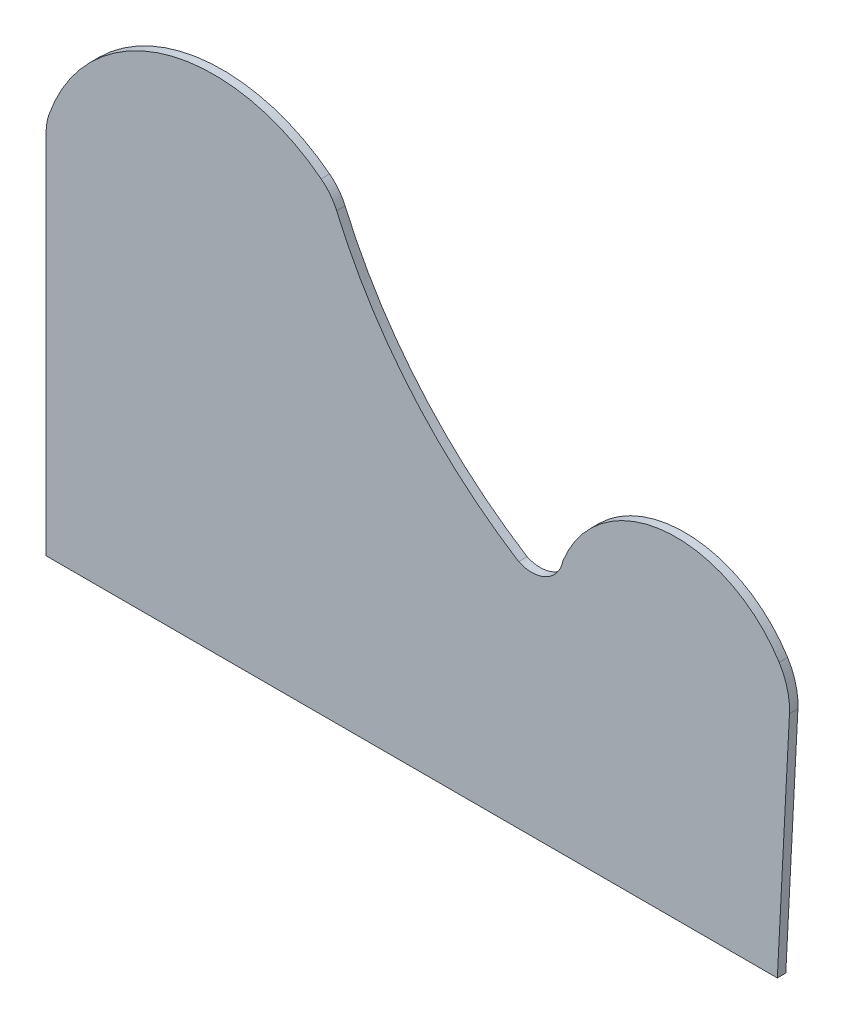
ISO-10303-21;
HEADER;
FILE_DESCRIPTION(('STEP AP214'),'2;1');
FILE_NAME('part.step','',(''),(''),'','','');
FILE_SCHEMA(('AUTOMOTIVE_DESIGN { 1 0 10303 214 1 1 1 1 }'));
ENDSEC;
DATA;
#1=APPLICATION_CONTEXT('core data for automotive mechanical design processes');
#2=APPLICATION_PROTOCOL_DEFINITION('international standard','automotive_design',2000,#1);
#3=PRODUCT_CONTEXT('',#1,'mechanical');
#4=PRODUCT('Part','Part','',(#3));
#5=PRODUCT_RELATED_PRODUCT_CATEGORY('part','',(#4));
#6=PRODUCT_DEFINITION_FORMATION('','',#4);
#7=PRODUCT_DEFINITION_CONTEXT('part definition',#1,'design');
#8=PRODUCT_DEFINITION('design','',#6,#7);
#9=PRODUCT_DEFINITION_SHAPE('','',#8);
#10=(LENGTH_UNIT() NAMED_UNIT(*) SI_UNIT(.MILLI.,.METRE.));
#11=(NAMED_UNIT(*) PLANE_ANGLE_UNIT() SI_UNIT($,.RADIAN.));
#12=(NAMED_UNIT(*) SI_UNIT($,.STERADIAN.) SOLID_ANGLE_UNIT());
#13=UNCERTAINTY_MEASURE_WITH_UNIT(LENGTH_MEASURE(1.E-05),#10,'distance_accuracy_value','');
#14=(GEOMETRIC_REPRESENTATION_CONTEXT(3) GLOBAL_UNCERTAINTY_ASSIGNED_CONTEXT((#13)) GLOBAL_UNIT_ASSIGNED_CONTEXT((#10,
#11,#12)) REPRESENTATION_CONTEXT('',''));
#15=CARTESIAN_POINT('',(0.,0.,0.));
#16=DIRECTION('',(0.,0.,1.));
#17=DIRECTION('',(1.,0.,0.));
#18=AXIS2_PLACEMENT_3D('',#15,#16,#17);
#19=CARTESIAN_POINT('',(0.,0.,-15.));
#20=DIRECTION('',(0.,0.,1.));
#21=DIRECTION('',(1.,0.,0.));
#22=AXIS2_PLACEMENT_3D('',#19,#20,#21);
#23=PLANE('',#22);
#24=DIRECTION('',(-0.0515364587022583,-0.998671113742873,0.));
#25=VECTOR('',#24,1.);
#26=CARTESIAN_POINT('',(518.072036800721,-26.7351260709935,-15.));
#27=LINE('',#26,#25);
#28=CARTESIAN_POINT('',(535.595522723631,312.834173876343,-15.));
#29=VERTEX_POINT('',#28);
#30=CARTESIAN_POINT('',(528.430035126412,173.981686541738,-15.));
#31=VERTEX_POINT('',#30);
#32=EDGE_CURVE('E114',#29,#31,#27,.T.);
#33=ORIENTED_EDGE('',*,*,#32,.T.);
#34=DIRECTION('',(-1.,0.,0.));
#35=VECTOR('',#34,1.);
#36=CARTESIAN_POINT('',(0.,173.981686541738,-15.));
#37=LINE('',#36,#35);
#38=CARTESIAN_POINT('',(96.0120985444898,173.981686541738,-15.));
#39=VERTEX_POINT('',#38);
#40=EDGE_CURVE('E140',#31,#39,#37,.T.);
#41=ORIENTED_EDGE('',*,*,#40,.T.);
#42=DIRECTION('',(0.,1.,0.));
#43=VECTOR('',#42,1.);
#44=CARTESIAN_POINT('',(96.0120985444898,0.,-15.));
#45=LINE('',#44,#43);
#46=CARTESIAN_POINT('',(96.0120985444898,390.867481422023,-15.));
#47=VERTEX_POINT('',#46);
#48=EDGE_CURVE('E136',#39,#47,#45,.T.);
#49=ORIENTED_EDGE('',*,*,#48,.T.);
#50=CARTESIAN_POINT('',(126.01209854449,390.867481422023,-15.));
#51=DIRECTION('',(0.,0.,1.));
#52=DIRECTION('',(1.,0.,0.));
#53=AXIS2_PLACEMENT_3D('',#50,#51,#52);
#54=CIRCLE('',#53,30.);
#55=CARTESIAN_POINT('',(97.6798278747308,400.730667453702,-15.));
#56=VERTEX_POINT('',#55);
#57=EDGE_CURVE('E142',#47,#56,#54,.F.);
#58=ORIENTED_EDGE('',*,*,#57,.T.);
#59=CARTESIAN_POINT('',(195.279411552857,366.753763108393,-15.));
#60=DIRECTION('',(0.,0.,1.));
#61=DIRECTION('',(1.,0.,0.));
#62=AXIS2_PLACEMENT_3D('',#59,#60,#61);
#63=CIRCLE('',#62,103.344611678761);
#64=CARTESIAN_POINT('',(258.713492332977,448.339461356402,-15.));
#65=VERTEX_POINT('',#64);
#66=EDGE_CURVE('E103',#56,#65,#63,.F.);
#67=ORIENTED_EDGE('',*,*,#66,.T.);
#68=CARTESIAN_POINT('',(240.299156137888,424.655875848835,-15.));
#69=DIRECTION('',(0.,0.,1.));
#70=DIRECTION('',(1.,0.,0.));
#71=AXIS2_PLACEMENT_3D('',#68,#69,#70);
#72=CIRCLE('',#71,30.);
#73=CARTESIAN_POINT('',(267.825723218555,436.584333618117,-15.));
#74=VERTEX_POINT('',#73);
#75=EDGE_CURVE('E119',#65,#74,#72,.F.);
#76=ORIENTED_EDGE('',*,*,#75,.T.);
#77=CARTESIAN_POINT('',(526.01209854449,548.467710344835,-15.));
#78=DIRECTION('',(0.,0.,1.));
#79=DIRECTION('',(1.,0.,0.));
#80=AXIS2_PLACEMENT_3D('',#77,#78,#79);
#81=CIRCLE('',#80,281.386023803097);
#82=CARTESIAN_POINT('',(375.446572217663,310.753350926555,-15.));
#83=VERTEX_POINT('',#82);
#84=EDGE_CURVE('E96',#83,#74,#81,.F.);
#85=ORIENTED_EDGE('',*,*,#84,.F.);
#86=CARTESIAN_POINT('',(383.206392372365,327.832005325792,-15.));
#87=DIRECTION('',(0.,0.,1.));
#88=DIRECTION('',(1.,0.,0.));
#89=AXIS2_PLACEMENT_3D('',#86,#87,#88);
#90=CIRCLE('',#89,18.7588710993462);
#91=CARTESIAN_POINT('',(401.59368414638,324.116800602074,-15.));
#92=VERTEX_POINT('',#91);
#93=EDGE_CURVE('E107',#83,#92,#90,.T.);
#94=ORIENTED_EDGE('',*,*,#93,.T.);
#95=CARTESIAN_POINT('',(468.596881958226,297.888088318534,-15.));
#96=DIRECTION('',(0.,0.,1.));
#97=DIRECTION('',(1.,0.,0.));
#98=AXIS2_PLACEMENT_3D('',#95,#96,#97);
#99=CIRCLE('',#98,71.9539704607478);
#100=CARTESIAN_POINT('',(529.512133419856,336.185686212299,-15.));
#101=VERTEX_POINT('',#100);
#102=EDGE_CURVE('E113',#92,#101,#99,.F.);
#103=ORIENTED_EDGE('',*,*,#102,.T.);
#104=CARTESIAN_POINT('',(495.648678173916,314.895632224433,-15.));
#105=DIRECTION('',(0.,0.,1.));
#106=DIRECTION('',(1.,0.,0.));
#107=AXIS2_PLACEMENT_3D('',#104,#105,#106);
#108=CIRCLE('',#107,40.);
#109=EDGE_CURVE('E126',#101,#29,#108,.F.);
#110=ORIENTED_EDGE('',*,*,#109,.T.);
#111=EDGE_LOOP('',(#33,#41,#49,#58,#67,#76,#85,#94,#103,#110));
#112=FACE_BOUND('',#111,.T.);
#113=ADVANCED_FACE('F35',(#112),#23,.F.);
#114=CARTESIAN_POINT('',(195.279411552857,366.753763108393,-5.));
#115=DIRECTION('',(0.,0.,1.));
#116=DIRECTION('',(1.,0.,0.));
#117=AXIS2_PLACEMENT_3D('',#114,#115,#116);
#118=CYLINDRICAL_SURFACE('',#117,103.344611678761);
#119=DIRECTION('',(0.,0.,1.));
#120=VECTOR('',#119,1.);
#121=CARTESIAN_POINT('',(97.6798278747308,400.730667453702,-5.));
#122=LINE('',#121,#120);
#123=CARTESIAN_POINT('',(97.6798278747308,400.730667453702,-9.99999999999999));
#124=VERTEX_POINT('',#123);
#125=EDGE_CURVE('E132',#56,#124,#122,.T.);
#126=ORIENTED_EDGE('',*,*,#125,.T.);
#127=CARTESIAN_POINT('',(195.279411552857,366.753763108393,-9.99999999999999));
#128=DIRECTION('',(0.,0.,-1.));
#129=DIRECTION('',(0.,1.,0.));
#130=AXIS2_PLACEMENT_3D('',#127,#128,#129);
#131=CIRCLE('',#130,103.344611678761);
#132=CARTESIAN_POINT('',(258.713492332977,448.339461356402,-10.));
#133=VERTEX_POINT('',#132);
#134=EDGE_CURVE('E169',#124,#133,#131,.T.);
#135=ORIENTED_EDGE('',*,*,#134,.T.);
#136=DIRECTION('',(0.,0.,1.));
#137=VECTOR('',#136,1.);
#138=CARTESIAN_POINT('',(258.713492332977,448.339461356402,-5.));
#139=LINE('',#138,#137);
#140=EDGE_CURVE('E129',#133,#65,#139,.F.);
#141=ORIENTED_EDGE('',*,*,#140,.T.);
#142=ORIENTED_EDGE('',*,*,#66,.F.);
#143=EDGE_LOOP('',(#126,#135,#141,#142));
#144=FACE_BOUND('',#143,.T.);
#145=ADVANCED_FACE('F166',(#144),#118,.T.);
#146=CARTESIAN_POINT('',(96.0120985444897,525.036251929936,-5.));
#147=DIRECTION('',(1.,0.,0.));
#148=DIRECTION('',(0.,1.,0.));
#149=AXIS2_PLACEMENT_3D('',#146,#147,#148);
#150=PLANE('',#149);
#151=DIRECTION('',(0.,0.,1.));
#152=VECTOR('',#151,1.);
#153=CARTESIAN_POINT('',(96.0120985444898,173.981686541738,-5.));
#154=LINE('',#153,#152);
#155=CARTESIAN_POINT('',(96.0120985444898,173.981686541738,-10.));
#156=VERTEX_POINT('',#155);
#157=EDGE_CURVE('E137',#39,#156,#154,.T.);
#158=ORIENTED_EDGE('',*,*,#157,.T.);
#159=DIRECTION('',(0.,-1.,0.));
#160=VECTOR('',#159,1.);
#161=CARTESIAN_POINT('',(96.0120985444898,476.514152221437,-10.));
#162=LINE('',#161,#160);
#163=CARTESIAN_POINT('',(96.0120985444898,390.867481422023,-9.99999999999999));
#164=VERTEX_POINT('',#163);
#165=EDGE_CURVE('E50',#164,#156,#162,.T.);
#166=ORIENTED_EDGE('',*,*,#165,.F.);
#167=DIRECTION('',(0.,0.,1.));
#168=VECTOR('',#167,1.);
#169=CARTESIAN_POINT('',(96.0120985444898,390.867481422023,-5.));
#170=LINE('',#169,#168);
#171=EDGE_CURVE('E135',#164,#47,#170,.F.);
#172=ORIENTED_EDGE('',*,*,#171,.T.);
#173=ORIENTED_EDGE('',*,*,#48,.F.);
#174=EDGE_LOOP('',(#158,#166,#172,#173));
#175=FACE_BOUND('',#174,.T.);
#176=ADVANCED_FACE('F191',(#175),#150,.F.);
#177=CARTESIAN_POINT('',(126.01209854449,390.867481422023,-5.));
#178=DIRECTION('',(0.,0.,1.));
#179=DIRECTION('',(1.,0.,0.));
#180=AXIS2_PLACEMENT_3D('',#177,#178,#179);
#181=CYLINDRICAL_SURFACE('',#180,30.);
#182=CARTESIAN_POINT('',(126.01209854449,390.867481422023,-9.99999999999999));
#183=DIRECTION('',(0.,0.,-1.));
#184=DIRECTION('',(0.,1.,0.));
#185=AXIS2_PLACEMENT_3D('',#182,#183,#184);
#186=CIRCLE('',#185,30.);
#187=EDGE_CURVE('E163',#124,#164,#186,.F.);
#188=ORIENTED_EDGE('',*,*,#187,.F.);
#189=ORIENTED_EDGE('',*,*,#125,.F.);
#190=ORIENTED_EDGE('',*,*,#57,.F.);
#191=ORIENTED_EDGE('',*,*,#171,.F.);
#192=EDGE_LOOP('',(#188,#189,#190,#191));
#193=FACE_BOUND('',#192,.T.);
#194=ADVANCED_FACE('F161',(#193),#181,.T.);
#195=CARTESIAN_POINT('',(383.206392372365,327.832005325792,-5.));
#196=DIRECTION('',(0.,0.,1.));
#197=DIRECTION('',(1.,0.,0.));
#198=AXIS2_PLACEMENT_3D('',#195,#196,#197);
#199=CYLINDRICAL_SURFACE('',#198,18.7588710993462);
#200=DIRECTION('',(0.,0.,1.));
#201=VECTOR('',#200,1.);
#202=CARTESIAN_POINT('',(375.446572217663,310.753350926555,-15.));
#203=LINE('',#202,#201);
#204=CARTESIAN_POINT('',(375.446572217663,310.753350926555,-9.99999999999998));
#205=VERTEX_POINT('',#204);
#206=EDGE_CURVE('E91',#83,#205,#203,.T.);
#207=ORIENTED_EDGE('',*,*,#206,.T.);
#208=CARTESIAN_POINT('',(383.206392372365,327.832005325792,-9.99999999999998));
#209=DIRECTION('',(0.,0.,-1.));
#210=DIRECTION('',(0.,1.,0.));
#211=AXIS2_PLACEMENT_3D('',#208,#209,#210);
#212=CIRCLE('',#211,18.7588710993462);
#213=CARTESIAN_POINT('',(401.59368414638,324.116800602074,-9.99999999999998));
#214=VERTEX_POINT('',#213);
#215=EDGE_CURVE('E201',#205,#214,#212,.F.);
#216=ORIENTED_EDGE('',*,*,#215,.T.);
#217=DIRECTION('',(0.,0.,1.));
#218=VECTOR('',#217,1.);
#219=CARTESIAN_POINT('',(401.59368414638,324.116800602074,-15.));
#220=LINE('',#219,#218);
#221=EDGE_CURVE('E104',#92,#214,#220,.T.);
#222=ORIENTED_EDGE('',*,*,#221,.F.);
#223=ORIENTED_EDGE('',*,*,#93,.F.);
#224=EDGE_LOOP('',(#207,#216,#222,#223));
#225=FACE_BOUND('',#224,.T.);
#226=ADVANCED_FACE('F108',(#225),#199,.F.);
#227=CARTESIAN_POINT('',(526.01209854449,548.467710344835,-5.));
#228=DIRECTION('',(0.,0.,1.));
#229=DIRECTION('',(1.,0.,0.));
#230=AXIS2_PLACEMENT_3D('',#227,#228,#229);
#231=CYLINDRICAL_SURFACE('',#230,281.386023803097);
#232=CARTESIAN_POINT('',(526.01209854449,548.467710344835,-10.));
#233=DIRECTION('',(0.,0.,-1.));
#234=DIRECTION('',(0.,1.,0.));
#235=AXIS2_PLACEMENT_3D('',#232,#233,#234);
#236=CIRCLE('',#235,281.386023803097);
#237=CARTESIAN_POINT('',(267.825723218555,436.584333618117,-9.99999999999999));
#238=VERTEX_POINT('',#237);
#239=EDGE_CURVE('E100',#205,#238,#236,.T.);
#240=ORIENTED_EDGE('',*,*,#239,.F.);
#241=ORIENTED_EDGE('',*,*,#206,.F.);
#242=ORIENTED_EDGE('',*,*,#84,.T.);
#243=DIRECTION('',(0.,0.,1.));
#244=VECTOR('',#243,1.);
#245=CARTESIAN_POINT('',(267.825723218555,436.584333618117,-5.));
#246=LINE('',#245,#244);
#247=EDGE_CURVE('E131',#74,#238,#246,.T.);
#248=ORIENTED_EDGE('',*,*,#247,.T.);
#249=EDGE_LOOP('',(#240,#241,#242,#248));
#250=FACE_BOUND('',#249,.T.);
#251=ADVANCED_FACE('F93',(#250),#231,.F.);
#252=CARTESIAN_POINT('',(468.596881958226,297.888088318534,-5.));
#253=DIRECTION('',(0.,0.,1.));
#254=DIRECTION('',(1.,0.,0.));
#255=AXIS2_PLACEMENT_3D('',#252,#253,#254);
#256=CYLINDRICAL_SURFACE('',#255,71.9539704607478);
#257=ORIENTED_EDGE('',*,*,#221,.T.);
#258=CARTESIAN_POINT('',(468.596881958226,297.888088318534,-9.99999999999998));
#259=DIRECTION('',(0.,0.,-1.));
#260=DIRECTION('',(0.,1.,0.));
#261=AXIS2_PLACEMENT_3D('',#258,#259,#260);
#262=CIRCLE('',#261,71.9539704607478);
#263=CARTESIAN_POINT('',(529.512133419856,336.185686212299,-9.99999999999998));
#264=VERTEX_POINT('',#263);
#265=EDGE_CURVE('E198',#214,#264,#262,.T.);
#266=ORIENTED_EDGE('',*,*,#265,.T.);
#267=DIRECTION('',(0.,0.,1.));
#268=VECTOR('',#267,1.);
#269=CARTESIAN_POINT('',(529.512133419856,336.185686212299,-5.));
#270=LINE('',#269,#268);
#271=EDGE_CURVE('E128',#264,#101,#270,.F.);
#272=ORIENTED_EDGE('',*,*,#271,.T.);
#273=ORIENTED_EDGE('',*,*,#102,.F.);
#274=EDGE_LOOP('',(#257,#266,#272,#273));
#275=FACE_BOUND('',#274,.T.);
#276=ADVANCED_FACE('F237',(#275),#256,.T.);
#277=CARTESIAN_POINT('',(240.299156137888,424.655875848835,-5.));
#278=DIRECTION('',(0.,0.,-1.));
#279=DIRECTION('',(-1.,0.,0.));
#280=AXIS2_PLACEMENT_3D('',#277,#278,#279);
#281=CYLINDRICAL_SURFACE('',#280,30.);
#282=CARTESIAN_POINT('',(240.299156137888,424.655875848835,-9.99999999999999));
#283=DIRECTION('',(0.,0.,-1.));
#284=DIRECTION('',(0.,1.,0.));
#285=AXIS2_PLACEMENT_3D('',#282,#283,#284);
#286=CIRCLE('',#285,30.);
#287=EDGE_CURVE('E173',#238,#133,#286,.F.);
#288=ORIENTED_EDGE('',*,*,#287,.F.);
#289=ORIENTED_EDGE('',*,*,#247,.F.);
#290=ORIENTED_EDGE('',*,*,#75,.F.);
#291=ORIENTED_EDGE('',*,*,#140,.F.);
#292=EDGE_LOOP('',(#288,#289,#290,#291));
#293=FACE_BOUND('',#292,.T.);
#294=ADVANCED_FACE('F240',(#293),#281,.T.);
#295=CARTESIAN_POINT('',(535.998809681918,320.649049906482,-5.));
#296=DIRECTION('',(-0.998671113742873,0.0515364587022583,0.));
#297=DIRECTION('',(-0.0515364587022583,-0.998671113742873,0.));
#298=AXIS2_PLACEMENT_3D('',#295,#296,#297);
#299=PLANE('',#298);
#300=DIRECTION('',(0.,0.,1.));
#301=VECTOR('',#300,1.);
#302=CARTESIAN_POINT('',(535.595522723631,312.834173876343,-5.));
#303=LINE('',#302,#301);
#304=CARTESIAN_POINT('',(535.595522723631,312.834173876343,-9.99999999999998));
#305=VERTEX_POINT('',#304);
#306=EDGE_CURVE('E144',#29,#305,#303,.T.);
#307=ORIENTED_EDGE('',*,*,#306,.T.);
#308=DIRECTION('',(-0.0515364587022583,-0.998671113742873,0.));
#309=VECTOR('',#308,1.);
#310=CARTESIAN_POINT('',(535.998809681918,320.649049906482,-9.99999999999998));
#311=LINE('',#310,#309);
#312=CARTESIAN_POINT('',(528.430035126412,173.981686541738,-9.99999999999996));
#313=VERTEX_POINT('',#312);
#314=EDGE_CURVE('E192',#305,#313,#311,.T.);
#315=ORIENTED_EDGE('',*,*,#314,.T.);
#316=DIRECTION('',(0.,0.,-1.));
#317=VECTOR('',#316,1.);
#318=CARTESIAN_POINT('',(528.430035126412,173.981686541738,-5.));
#319=LINE('',#318,#317);
#320=EDGE_CURVE('E43',#313,#31,#319,.T.);
#321=ORIENTED_EDGE('',*,*,#320,.T.);
#322=ORIENTED_EDGE('',*,*,#32,.F.);
#323=EDGE_LOOP('',(#307,#315,#321,#322));
#324=FACE_BOUND('',#323,.T.);
#325=ADVANCED_FACE('F208',(#324),#299,.F.);
#326=CARTESIAN_POINT('',(495.648678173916,314.895632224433,-5.));
#327=DIRECTION('',(0.,0.,1.));
#328=DIRECTION('',(1.,0.,0.));
#329=AXIS2_PLACEMENT_3D('',#326,#327,#328);
#330=CYLINDRICAL_SURFACE('',#329,40.);
#331=CARTESIAN_POINT('',(495.648678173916,314.895632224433,-9.99999999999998));
#332=DIRECTION('',(0.,0.,-1.));
#333=DIRECTION('',(0.,1.,0.));
#334=AXIS2_PLACEMENT_3D('',#331,#332,#333);
#335=CIRCLE('',#334,40.);
#336=EDGE_CURVE('E194',#305,#264,#335,.F.);
#337=ORIENTED_EDGE('',*,*,#336,.F.);
#338=ORIENTED_EDGE('',*,*,#306,.F.);
#339=ORIENTED_EDGE('',*,*,#109,.F.);
#340=ORIENTED_EDGE('',*,*,#271,.F.);
#341=EDGE_LOOP('',(#337,#338,#339,#340));
#342=FACE_BOUND('',#341,.T.);
#343=ADVANCED_FACE('F210',(#342),#330,.T.);
#344=CARTESIAN_POINT('',(64.8682635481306,173.981686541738,-5.));
#345=DIRECTION('',(0.,1.,0.));
#346=DIRECTION('',(-1.,0.,0.));
#347=AXIS2_PLACEMENT_3D('',#344,#345,#346);
#348=PLANE('',#347);
#349=ORIENTED_EDGE('',*,*,#320,.F.);
#350=DIRECTION('',(-1.,0.,0.));
#351=VECTOR('',#350,1.);
#352=CARTESIAN_POINT('',(64.8682635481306,173.981686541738,-9.99999999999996));
#353=LINE('',#352,#351);
#354=EDGE_CURVE('E11',#313,#156,#353,.T.);
#355=ORIENTED_EDGE('',*,*,#354,.T.);
#356=ORIENTED_EDGE('',*,*,#157,.F.);
#357=ORIENTED_EDGE('',*,*,#40,.F.);
#358=EDGE_LOOP('',(#349,#355,#356,#357));
#359=FACE_BOUND('',#358,.T.);
#360=ADVANCED_FACE('F37',(#359),#348,.F.);
#361=CARTESIAN_POINT('',(535.648678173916,476.514152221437,-10.));
#362=DIRECTION('',(0.,0.,-1.));
#363=DIRECTION('',(0.,1.,0.));
#364=AXIS2_PLACEMENT_3D('',#361,#362,#363);
#365=PLANE('',#364);
#366=ORIENTED_EDGE('',*,*,#187,.T.);
#367=ORIENTED_EDGE('',*,*,#165,.T.);
#368=ORIENTED_EDGE('',*,*,#354,.F.);
#369=ORIENTED_EDGE('',*,*,#314,.F.);
#370=ORIENTED_EDGE('',*,*,#336,.T.);
#371=ORIENTED_EDGE('',*,*,#265,.F.);
#372=ORIENTED_EDGE('',*,*,#215,.F.);
#373=ORIENTED_EDGE('',*,*,#239,.T.);
#374=ORIENTED_EDGE('',*,*,#287,.T.);
#375=ORIENTED_EDGE('',*,*,#134,.F.);
#376=EDGE_LOOP('',(#366,#367,#368,#369,#370,#371,#372,#373,#374,#375));
#377=FACE_BOUND('',#376,.T.);
#378=ADVANCED_FACE('F189',(#377),#365,.F.);
#379=CLOSED_SHELL('',(#113,#145,#176,#194,#226,#251,#276,#294,#325,#343,#360,#378));
#380=MANIFOLD_SOLID_BREP('B2',#379);
#381=ADVANCED_BREP_SHAPE_REPRESENTATION('',(#18,#380),#14);
#382=SHAPE_DEFINITION_REPRESENTATION(#9,#381);
ENDSEC;
END-ISO-10303-21;
